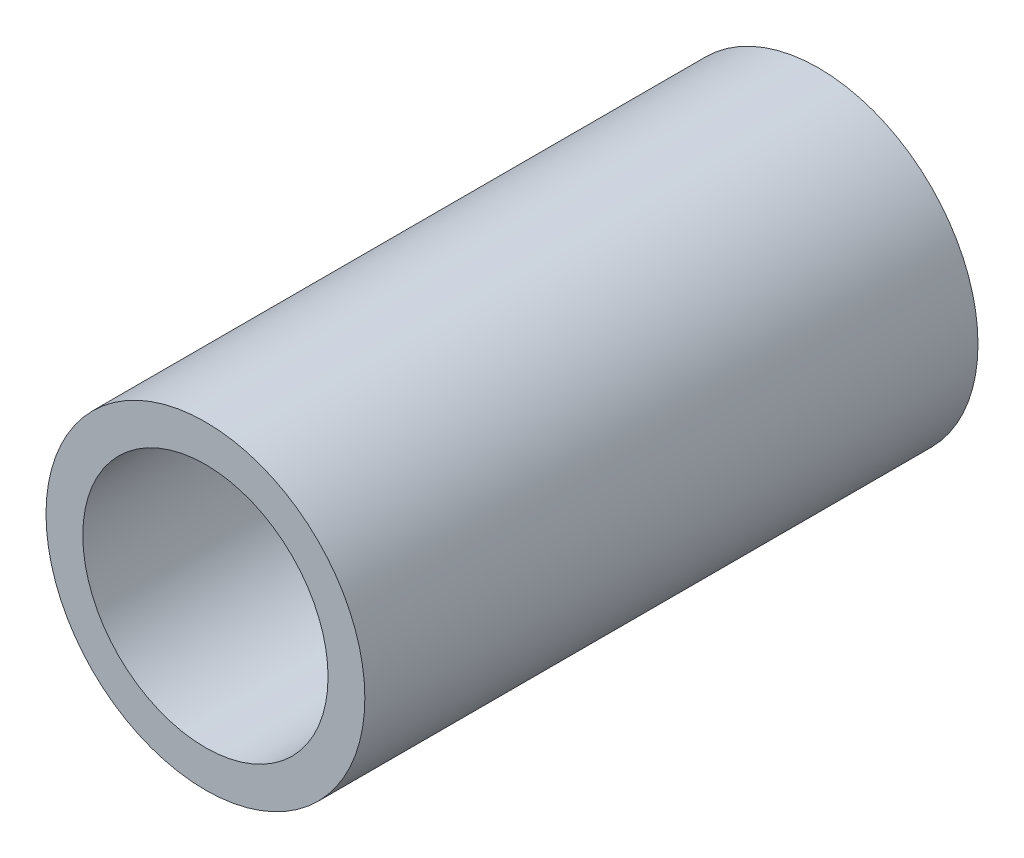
ISO-10303-21;
HEADER;
FILE_DESCRIPTION(('STEP AP214'),'2;1');
FILE_NAME('part.step','',(''),(''),'','','');
FILE_SCHEMA(('AUTOMOTIVE_DESIGN { 1 0 10303 214 1 1 1 1 }'));
ENDSEC;
DATA;
#1=APPLICATION_CONTEXT('core data for automotive mechanical design processes');
#2=APPLICATION_PROTOCOL_DEFINITION('international standard','automotive_design',2000,#1);
#3=PRODUCT_CONTEXT('',#1,'mechanical');
#4=PRODUCT('Part','Part','',(#3));
#5=PRODUCT_RELATED_PRODUCT_CATEGORY('part','',(#4));
#6=PRODUCT_DEFINITION_FORMATION('','',#4);
#7=PRODUCT_DEFINITION_CONTEXT('part definition',#1,'design');
#8=PRODUCT_DEFINITION('design','',#6,#7);
#9=PRODUCT_DEFINITION_SHAPE('','',#8);
#10=(LENGTH_UNIT() NAMED_UNIT(*) SI_UNIT(.MILLI.,.METRE.));
#11=(NAMED_UNIT(*) PLANE_ANGLE_UNIT() SI_UNIT($,.RADIAN.));
#12=(NAMED_UNIT(*) SI_UNIT($,.STERADIAN.) SOLID_ANGLE_UNIT());
#13=UNCERTAINTY_MEASURE_WITH_UNIT(LENGTH_MEASURE(1.E-05),#10,'distance_accuracy_value','');
#14=(GEOMETRIC_REPRESENTATION_CONTEXT(3) GLOBAL_UNCERTAINTY_ASSIGNED_CONTEXT((#13)) GLOBAL_UNIT_ASSIGNED_CONTEXT((#10,
#11,#12)) REPRESENTATION_CONTEXT('',''));
#15=CARTESIAN_POINT('',(0.,0.,0.));
#16=DIRECTION('',(0.,0.,1.));
#17=DIRECTION('',(1.,0.,0.));
#18=AXIS2_PLACEMENT_3D('',#15,#16,#17);
#19=CARTESIAN_POINT('',(0.,0.,50.));
#20=DIRECTION('',(0.,0.,1.));
#21=DIRECTION('',(1.,0.,0.));
#22=AXIS2_PLACEMENT_3D('',#19,#20,#21);
#23=PLANE('',#22);
#24=CARTESIAN_POINT('',(0.,0.,50.));
#25=DIRECTION('',(0.,0.,1.));
#26=DIRECTION('',(1.,0.,0.));
#27=AXIS2_PLACEMENT_3D('',#24,#25,#26);
#28=CIRCLE('',#27,13.);
#29=CARTESIAN_POINT('',(13.,0.,50.));
#30=VERTEX_POINT('',#29);
#31=EDGE_CURVE('E10',#30,#30,#28,.T.);
#32=ORIENTED_EDGE('',*,*,#31,.T.);
#33=EDGE_LOOP('',(#32));
#34=FACE_BOUND('',#33,.T.);
#35=CARTESIAN_POINT('',(0.,0.,50.));
#36=DIRECTION('',(0.,0.,1.));
#37=DIRECTION('',(1.,0.,0.));
#38=AXIS2_PLACEMENT_3D('',#35,#36,#37);
#39=CIRCLE('',#38,10.);
#40=CARTESIAN_POINT('',(10.,0.,50.));
#41=VERTEX_POINT('',#40);
#42=EDGE_CURVE('E41',#41,#41,#39,.T.);
#43=ORIENTED_EDGE('',*,*,#42,.F.);
#44=EDGE_LOOP('',(#43));
#45=FACE_BOUND('',#44,.T.);
#46=ADVANCED_FACE('F30',(#34,#45),#23,.T.);
#47=CARTESIAN_POINT('',(0.,0.,0.));
#48=DIRECTION('',(0.,0.,1.));
#49=DIRECTION('',(1.,0.,0.));
#50=AXIS2_PLACEMENT_3D('',#47,#48,#49);
#51=PLANE('',#50);
#52=CARTESIAN_POINT('',(0.,0.,0.));
#53=DIRECTION('',(0.,0.,1.));
#54=DIRECTION('',(1.,0.,0.));
#55=AXIS2_PLACEMENT_3D('',#52,#53,#54);
#56=CIRCLE('',#55,13.);
#57=CARTESIAN_POINT('',(13.,0.,0.));
#58=VERTEX_POINT('',#57);
#59=EDGE_CURVE('E34',#58,#58,#56,.T.);
#60=ORIENTED_EDGE('',*,*,#59,.F.);
#61=EDGE_LOOP('',(#60));
#62=FACE_BOUND('',#61,.T.);
#63=CARTESIAN_POINT('',(0.,0.,0.));
#64=DIRECTION('',(0.,0.,1.));
#65=DIRECTION('',(1.,0.,0.));
#66=AXIS2_PLACEMENT_3D('',#63,#64,#65);
#67=CIRCLE('',#66,10.);
#68=CARTESIAN_POINT('',(10.,0.,0.));
#69=VERTEX_POINT('',#68);
#70=EDGE_CURVE('E43',#69,#69,#67,.T.);
#71=ORIENTED_EDGE('',*,*,#70,.T.);
#72=EDGE_LOOP('',(#71));
#73=FACE_BOUND('',#72,.T.);
#74=ADVANCED_FACE('F53',(#62,#73),#51,.F.);
#75=CARTESIAN_POINT('',(0.,0.,50.));
#76=DIRECTION('',(0.,0.,-1.));
#77=DIRECTION('',(-1.,0.,0.));
#78=AXIS2_PLACEMENT_3D('',#75,#76,#77);
#79=CYLINDRICAL_SURFACE('',#78,13.);
#80=ORIENTED_EDGE('',*,*,#31,.F.);
#81=EDGE_LOOP('',(#80));
#82=FACE_BOUND('',#81,.T.);
#83=ORIENTED_EDGE('',*,*,#59,.T.);
#84=EDGE_LOOP('',(#83));
#85=FACE_BOUND('',#84,.T.);
#86=ADVANCED_FACE('F32',(#82,#85),#79,.T.);
#87=CARTESIAN_POINT('',(0.,0.,50.));
#88=DIRECTION('',(0.,0.,-1.));
#89=DIRECTION('',(-1.,0.,0.));
#90=AXIS2_PLACEMENT_3D('',#87,#88,#89);
#91=CYLINDRICAL_SURFACE('',#90,10.);
#92=ORIENTED_EDGE('',*,*,#42,.T.);
#93=EDGE_LOOP('',(#92));
#94=FACE_BOUND('',#93,.T.);
#95=ORIENTED_EDGE('',*,*,#70,.F.);
#96=EDGE_LOOP('',(#95));
#97=FACE_BOUND('',#96,.T.);
#98=ADVANCED_FACE('F49',(#94,#97),#91,.F.);
#99=CLOSED_SHELL('',(#46,#74,#86,#98));
#100=MANIFOLD_SOLID_BREP('B2',#99);
#101=ADVANCED_BREP_SHAPE_REPRESENTATION('',(#18,#100),#14);
#102=SHAPE_DEFINITION_REPRESENTATION(#9,#101);
ENDSEC;
END-ISO-10303-21;
